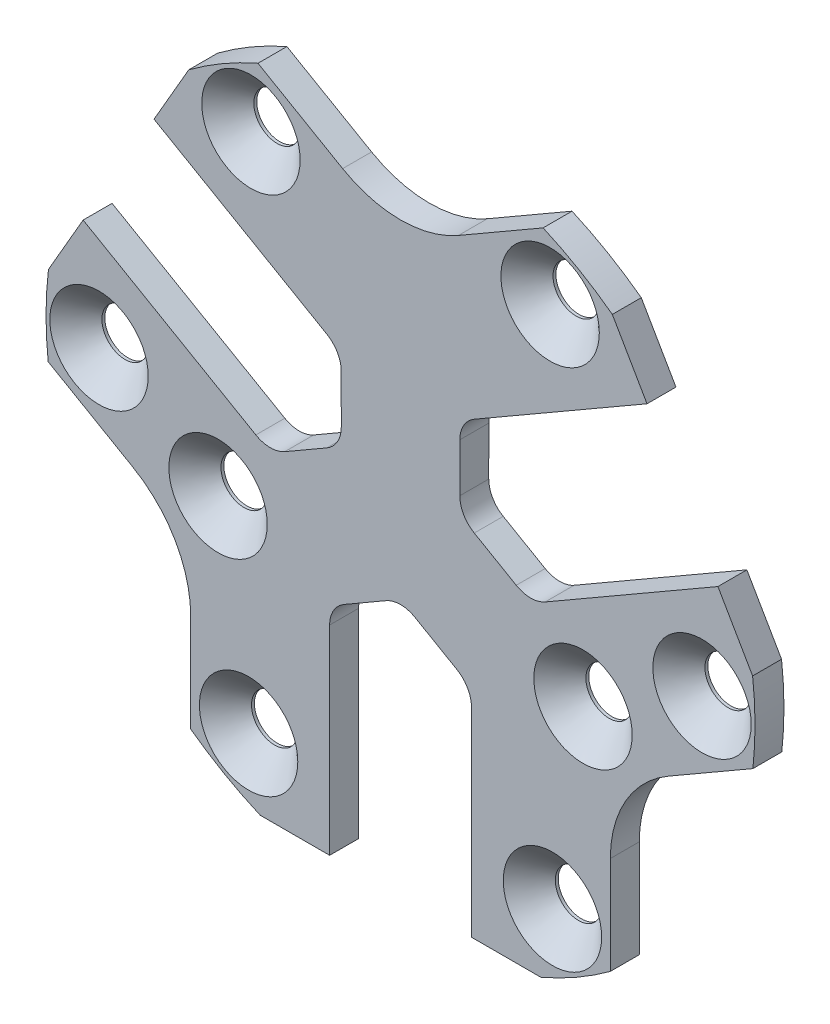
from build123d import *

# Parameters (mm, degrees)
BASE_EXTRUSION_DEPTH                     = 2
FRAISAGE_POUR_VIS_T_TE_FRAIS_E_F_2_COUNT = 2
FRAISAGE_POUR_VIS_T_TE_FRAIS_E_F_2_PITCH = 20.676914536
FRAISAGE_POUR_VIS_T_TE_FRAIS_E_F_3_COUNT = 2
FRAISAGE_POUR_VIS_T_TE_FRAIS_E_F_3_PITCH = 36.093628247
FRAISAGE_POUR_VIS_T_TE_FRAIS_E_F_4_COUNT = 2
FRAISAGE_POUR_VIS_T_TE_FRAIS_E_F_4_PITCH = 32.446449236
FRAISAGE_POUR_VIS_T_TE_FRAIS_E_F_5_COUNT = 2
FRAISAGE_POUR_VIS_T_TE_FRAIS_E_F_5_PITCH = 41.676914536
FRAISAGE_POUR_VIS_T_TE_FRAIS_E_F_6_COUNT = 2
FRAISAGE_POUR_VIS_T_TE_FRAIS_E_F_6_PITCH = 36.093628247
FRAISAGE_POUR_VIS_T_TE_FRAIS_E_F_7_COUNT = 2
FRAISAGE_POUR_VIS_T_TE_FRAIS_E_F_7_PITCH = 23.048861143
FRAISAGE_POUR_VIS_T_TE_FRAIS_E_F_8_COUNT = 2
FRAISAGE_POUR_VIS_T_TE_FRAIS_E_F_8_PITCH = 21


with BuildPart() as part:
    # Esquisse1 → Base-Extrusion (new body)
    with BuildSketch(Plane.XY):
        with BuildLine():
            Line((-4.9, -8.715), (-4.9, -22.5))
            Line((-4.9, -22.5), (-9.695359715, -22.5))
            ThreePointArc((-9.695359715, -22.5), (-12.175658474, -21.260370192), (-14.5, -19.748417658))
            Line((-14.5, -19.748417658), (-14.5, -12.990381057))
            ThreePointArc((-14.5, -12.990381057), (-15.57179677, -8.990381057), (-18.5, -6.062177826))
            Line((-18.5, -6.062177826), (-24.352631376, -2.683159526))
            ThreePointArc((-24.352631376, -2.683159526), (-24.499849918, 0.08575555), (-24.333251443, 2.853572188))
            Line((-24.333251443, 2.853572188), (-21.935571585, 7.006475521))
            Line((-21.935571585, 7.006475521), (-9.997411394, 0.113975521))
            ThreePointArc((-9.997411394, 0.113975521), (-8.997588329, -0.153973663), (-7.99771787, 0.113798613))
            Line((-7.99771787, 0.113798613), (-5.097125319, 1.787772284))
            ThreePointArc((-5.097125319, 1.787772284), (-4.364768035, 2.52), (-4.096818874, 3.52035387))
            Line((-4.096818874, 3.52035387), (-4.097411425, 6.869327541))
            ThreePointArc((-4.097411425, 6.869327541), (-4.365449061, 7.869126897), (-5.097411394, 8.601024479))
            Line((-5.097411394, 8.601024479), (-17.035571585, 15.493524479))
            Line((-17.035571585, 15.493524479), (-14.637891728, 19.646427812))
            ThreePointArc((-14.637891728, 19.646427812), (-12.324191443, 21.174614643), (-9.852631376, 22.431577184))
            Line((-9.852631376, 22.431577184), (-4, 19.052558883))
            ThreePointArc((-4, 19.052558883), (0, 17.980762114), (4, 19.052558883))
            Line((4, 19.052558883), (9.852631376, 22.431577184))
            ThreePointArc((9.852631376, 22.431577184), (12.324191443, 21.174614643), (14.637891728, 19.646427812))
            Line((14.637891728, 19.646427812), (17.035571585, 15.493524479))
            Line((17.035571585, 15.493524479), (5.097411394, 8.601024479))
            ThreePointArc((5.097411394, 8.601024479), (4.365449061, 7.869126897), (4.097411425, 6.869327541))
            Line((4.097411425, 6.869327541), (4.096818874, 3.52035387))
            ThreePointArc((4.096818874, 3.52035387), (4.364768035, 2.52), (5.097125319, 1.787772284))
            Line((5.097125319, 1.787772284), (7.99771787, 0.113798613))
            ThreePointArc((7.99771787, 0.113798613), (8.997588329, -0.153973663), (9.997411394, 0.113975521))
            Line((9.997411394, 0.113975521), (21.935571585, 7.006475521))
            Line((21.935571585, 7.006475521), (24.333251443, 2.853572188))
            ThreePointArc((24.333251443, 2.853572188), (24.499849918, 0.08575555), (24.352631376, -2.683159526))
            Line((24.352631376, -2.683159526), (18.5, -6.062177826))
            ThreePointArc((18.5, -6.062177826), (15.57179677, -8.990381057), (14.5, -12.990381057))
            Line((14.5, -12.990381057), (14.5, -19.748417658))
            ThreePointArc((14.5, -19.748417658), (12.175658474, -21.260370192), (9.695359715, -22.5))
            Line((9.695359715, -22.5), (4.9, -22.5))
            Line((4.9, -22.5), (4.9, -8.715))
            ThreePointArc((4.9, -8.715), (4.632139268, -7.715153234), (3.900306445, -6.983126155))
            Line((3.900306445, -6.983126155), (1.000306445, -5.308126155))
            ThreePointArc((1.000306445, -5.308126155), (0, -5.04), (-1.000306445, -5.308126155))
            Line((-1.000306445, -5.308126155), (-3.900306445, -6.983126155))
            ThreePointArc((-3.900306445, -6.983126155), (-4.632139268, -7.715153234), (-4.9, -8.715))
        make_face()
    extrude(amount=BASE_EXTRUSION_DEPTH)

    # Esquisse8 → Fraisage pour vis _ t_te frais_e _ fond (revolve, cut)
    with BuildSketch(Plane(origin=(10.338457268, 18.09326674, 2), x_dir=(0, -1, 0), z_dir=(1, 0, 0))):
        Polygon((0, 0), (0, 2), (1.6, 2), (1.6, 1.8), (3.4, 0), align=None)
    fraisage_pour_vis_t_te_frais_e_fond = revolve(axis=Axis((10.338457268, 18.09326674, 8.35), (0, 0, -1)), mode=Mode.SUBTRACT)

    # Fraisage pour vis _ t_te frais_e _ f 2: Fraisage pour vis _ t_te frais_e _ fond ×2
    with Locations(*[(-i * FRAISAGE_POUR_VIS_T_TE_FRAIS_E_F_2_PITCH, 0, 0) for i in range(1, FRAISAGE_POUR_VIS_T_TE_FRAIS_E_F_2_COUNT)]):
        add(fraisage_pour_vis_t_te_frais_e_fond, mode=Mode.SUBTRACT)

    # Fraisage pour vis _ t_te frais_e _ f 3: Fraisage pour vis _ t_te frais_e _ fond ×2
    with Locations(*[Vector(-0.8637789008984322, -0.5038710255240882, 0) * (i * FRAISAGE_POUR_VIS_T_TE_FRAIS_E_F_3_PITCH) for i in range(1, FRAISAGE_POUR_VIS_T_TE_FRAIS_E_F_3_COUNT)]):
        add(fraisage_pour_vis_t_te_frais_e_fond, mode=Mode.SUBTRACT)

    # Fraisage pour vis _ t_te frais_e _ f 4: Fraisage pour vis _ t_te frais_e _ fond ×2
    with Locations(*[Vector(-0.7073092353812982, -0.7069042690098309, 0) * (i * FRAISAGE_POUR_VIS_T_TE_FRAIS_E_F_4_PITCH) for i in range(1, FRAISAGE_POUR_VIS_T_TE_FRAIS_E_F_4_COUNT)]):
        add(fraisage_pour_vis_t_te_frais_e_fond, mode=Mode.SUBTRACT)

    # Fraisage pour vis _ t_te frais_e _ f 5: Fraisage pour vis _ t_te frais_e _ fond ×2
    with Locations(*[Vector(-0.49999999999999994, -0.8660254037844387, 0) * (i * FRAISAGE_POUR_VIS_T_TE_FRAIS_E_F_5_PITCH) for i in range(1, FRAISAGE_POUR_VIS_T_TE_FRAIS_E_F_5_COUNT)]):
        add(fraisage_pour_vis_t_te_frais_e_fond, mode=Mode.SUBTRACT)

    # Fraisage pour vis _ t_te frais_e _ f 6: Fraisage pour vis _ t_te frais_e _ fond ×2
    with Locations(*[Vector(0.004475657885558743, -0.9999899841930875, 0) * (i * FRAISAGE_POUR_VIS_T_TE_FRAIS_E_F_6_PITCH) for i in range(1, FRAISAGE_POUR_VIS_T_TE_FRAIS_E_F_6_COUNT)]):
        add(fraisage_pour_vis_t_te_frais_e_fond, mode=Mode.SUBTRACT)

    # Fraisage pour vis _ t_te frais_e _ f 7: Fraisage pour vis _ t_te frais_e _ fond ×2
    with Locations(*[Vector(0.09860611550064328, -0.9951265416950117, 0) * (i * FRAISAGE_POUR_VIS_T_TE_FRAIS_E_F_7_PITCH) for i in range(1, FRAISAGE_POUR_VIS_T_TE_FRAIS_E_F_7_COUNT)]):
        add(fraisage_pour_vis_t_te_frais_e_fond, mode=Mode.SUBTRACT)

    # Fraisage pour vis _ t_te frais_e _ f 8: Fraisage pour vis _ t_te frais_e _ fond ×2
    with Locations(*[Vector(0.5000000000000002, -0.8660254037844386, 0) * (i * FRAISAGE_POUR_VIS_T_TE_FRAIS_E_F_8_PITCH) for i in range(1, FRAISAGE_POUR_VIS_T_TE_FRAIS_E_F_8_COUNT)]):
        add(fraisage_pour_vis_t_te_frais_e_fond, mode=Mode.SUBTRACT)


solid = part.part
